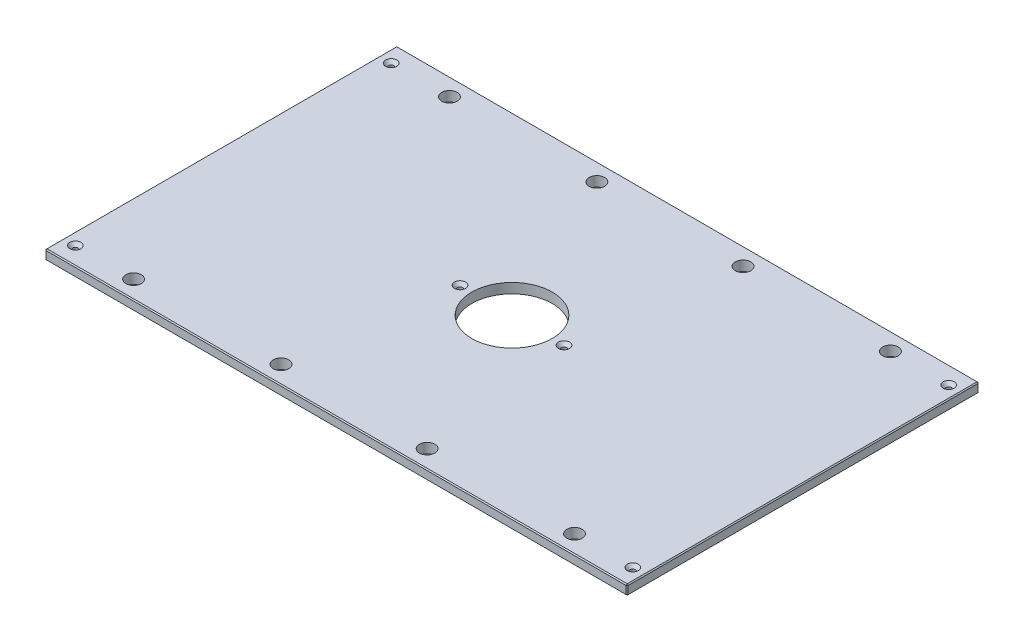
ISO-10303-21;
HEADER;
FILE_DESCRIPTION(('STEP AP214'),'2;1');
FILE_NAME('part.step','',(''),(''),'','','');
FILE_SCHEMA(('AUTOMOTIVE_DESIGN { 1 0 10303 214 1 1 1 1 }'));
ENDSEC;
DATA;
#1=APPLICATION_CONTEXT('core data for automotive mechanical design processes');
#2=APPLICATION_PROTOCOL_DEFINITION('international standard','automotive_design',2000,#1);
#3=PRODUCT_CONTEXT('',#1,'mechanical');
#4=PRODUCT('Part','Part','',(#3));
#5=PRODUCT_RELATED_PRODUCT_CATEGORY('part','',(#4));
#6=PRODUCT_DEFINITION_FORMATION('','',#4);
#7=PRODUCT_DEFINITION_CONTEXT('part definition',#1,'design');
#8=PRODUCT_DEFINITION('design','',#6,#7);
#9=PRODUCT_DEFINITION_SHAPE('','',#8);
#10=(LENGTH_UNIT() NAMED_UNIT(*) SI_UNIT(.MILLI.,.METRE.));
#11=(NAMED_UNIT(*) PLANE_ANGLE_UNIT() SI_UNIT($,.RADIAN.));
#12=(NAMED_UNIT(*) SI_UNIT($,.STERADIAN.) SOLID_ANGLE_UNIT());
#13=UNCERTAINTY_MEASURE_WITH_UNIT(LENGTH_MEASURE(1.E-05),#10,'distance_accuracy_value','');
#14=(GEOMETRIC_REPRESENTATION_CONTEXT(3) GLOBAL_UNCERTAINTY_ASSIGNED_CONTEXT((#13)) GLOBAL_UNIT_ASSIGNED_CONTEXT((#10,
#11,#12)) REPRESENTATION_CONTEXT('',''));
#15=CARTESIAN_POINT('',(0.,0.,0.));
#16=DIRECTION('',(0.,0.,1.));
#17=DIRECTION('',(1.,0.,0.));
#18=AXIS2_PLACEMENT_3D('',#15,#16,#17);
#19=CARTESIAN_POINT('',(-373.0625,12.7,-225.425));
#20=DIRECTION('',(1.,0.,0.));
#21=DIRECTION('',(0.,0.,-1.));
#22=AXIS2_PLACEMENT_3D('',#19,#20,#21);
#23=PLANE('',#22);
#24=DIRECTION('',(0.,0.,-1.));
#25=VECTOR('',#24,1.);
#26=CARTESIAN_POINT('',(-373.0625,11.4299999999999,-225.425));
#27=LINE('',#26,#25);
#28=CARTESIAN_POINT('',(-373.0625,11.4299999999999,224.155));
#29=VERTEX_POINT('',#28);
#30=CARTESIAN_POINT('',(-373.0625,11.4299999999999,-224.155));
#31=VERTEX_POINT('',#30);
#32=EDGE_CURVE('E135',#29,#31,#27,.T.);
#33=ORIENTED_EDGE('',*,*,#32,.T.);
#34=DIRECTION('',(0.,-1.,0.));
#35=VECTOR('',#34,1.);
#36=CARTESIAN_POINT('',(-373.0625,12.7,-224.155));
#37=LINE('',#36,#35);
#38=CARTESIAN_POINT('',(-373.0625,1.2700000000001,-224.155));
#39=VERTEX_POINT('',#38);
#40=EDGE_CURVE('E131',#31,#39,#37,.T.);
#41=ORIENTED_EDGE('',*,*,#40,.T.);
#42=DIRECTION('',(0.,0.,1.));
#43=VECTOR('',#42,1.);
#44=CARTESIAN_POINT('',(-373.0625,1.2700000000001,-225.425));
#45=LINE('',#44,#43);
#46=CARTESIAN_POINT('',(-373.0625,1.2700000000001,224.155));
#47=VERTEX_POINT('',#46);
#48=EDGE_CURVE('E126',#39,#47,#45,.T.);
#49=ORIENTED_EDGE('',*,*,#48,.T.);
#50=DIRECTION('',(0.,1.,0.));
#51=VECTOR('',#50,1.);
#52=CARTESIAN_POINT('',(-373.0625,12.7,224.155));
#53=LINE('',#52,#51);
#54=EDGE_CURVE('E128',#47,#29,#53,.T.);
#55=ORIENTED_EDGE('',*,*,#54,.T.);
#56=EDGE_LOOP('',(#33,#41,#49,#55));
#57=FACE_BOUND('',#56,.T.);
#58=ADVANCED_FACE('F35',(#57),#23,.F.);
#59=CARTESIAN_POINT('',(-373.0625,12.7,225.425));
#60=DIRECTION('',(0.,0.,-1.));
#61=DIRECTION('',(-1.,0.,0.));
#62=AXIS2_PLACEMENT_3D('',#59,#60,#61);
#63=PLANE('',#62);
#64=DIRECTION('',(1.,0.,0.));
#65=VECTOR('',#64,1.);
#66=CARTESIAN_POINT('',(-373.0625,1.2700000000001,225.425));
#67=LINE('',#66,#65);
#68=CARTESIAN_POINT('',(-371.7925,1.2700000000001,225.425));
#69=VERTEX_POINT('',#68);
#70=CARTESIAN_POINT('',(371.7925,1.2700000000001,225.425));
#71=VERTEX_POINT('',#70);
#72=EDGE_CURVE('E58',#69,#71,#67,.T.);
#73=ORIENTED_EDGE('',*,*,#72,.T.);
#74=DIRECTION('',(0.,1.,0.));
#75=VECTOR('',#74,1.);
#76=CARTESIAN_POINT('',(371.7925,12.7,225.425));
#77=LINE('',#76,#75);
#78=CARTESIAN_POINT('',(371.7925,11.4299999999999,225.425));
#79=VERTEX_POINT('',#78);
#80=EDGE_CURVE('E11',#71,#79,#77,.T.);
#81=ORIENTED_EDGE('',*,*,#80,.T.);
#82=DIRECTION('',(-1.,0.,0.));
#83=VECTOR('',#82,1.);
#84=CARTESIAN_POINT('',(-373.0625,11.4299999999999,225.425));
#85=LINE('',#84,#83);
#86=CARTESIAN_POINT('',(-371.7925,11.4299999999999,225.425));
#87=VERTEX_POINT('',#86);
#88=EDGE_CURVE('E44',#79,#87,#85,.T.);
#89=ORIENTED_EDGE('',*,*,#88,.T.);
#90=DIRECTION('',(0.,-1.,0.));
#91=VECTOR('',#90,1.);
#92=CARTESIAN_POINT('',(-371.7925,12.7,225.425));
#93=LINE('',#92,#91);
#94=EDGE_CURVE('E303',#87,#69,#93,.T.);
#95=ORIENTED_EDGE('',*,*,#94,.T.);
#96=EDGE_LOOP('',(#73,#81,#89,#95));
#97=FACE_BOUND('',#96,.T.);
#98=ADVANCED_FACE('F372',(#97),#63,.F.);
#99=CARTESIAN_POINT('',(373.0625,12.7,-225.425));
#100=DIRECTION('',(-1.,0.,0.));
#101=DIRECTION('',(0.,0.,1.));
#102=AXIS2_PLACEMENT_3D('',#99,#100,#101);
#103=PLANE('',#102);
#104=DIRECTION('',(0.,0.,-1.));
#105=VECTOR('',#104,1.);
#106=CARTESIAN_POINT('',(373.0625,1.2700000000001,-225.425));
#107=LINE('',#106,#105);
#108=CARTESIAN_POINT('',(373.0625,1.2700000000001,224.155));
#109=VERTEX_POINT('',#108);
#110=CARTESIAN_POINT('',(373.0625,1.2700000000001,-224.155));
#111=VERTEX_POINT('',#110);
#112=EDGE_CURVE('E298',#109,#111,#107,.T.);
#113=ORIENTED_EDGE('',*,*,#112,.T.);
#114=DIRECTION('',(0.,1.,0.));
#115=VECTOR('',#114,1.);
#116=CARTESIAN_POINT('',(373.0625,12.7,-224.155));
#117=LINE('',#116,#115);
#118=CARTESIAN_POINT('',(373.0625,11.4299999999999,-224.155));
#119=VERTEX_POINT('',#118);
#120=EDGE_CURVE('E300',#111,#119,#117,.T.);
#121=ORIENTED_EDGE('',*,*,#120,.T.);
#122=DIRECTION('',(0.,0.,1.));
#123=VECTOR('',#122,1.);
#124=CARTESIAN_POINT('',(373.0625,11.4299999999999,225.425));
#125=LINE('',#124,#123);
#126=CARTESIAN_POINT('',(373.0625,11.4299999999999,224.155));
#127=VERTEX_POINT('',#126);
#128=EDGE_CURVE('E296',#119,#127,#125,.T.);
#129=ORIENTED_EDGE('',*,*,#128,.T.);
#130=DIRECTION('',(0.,-1.,0.));
#131=VECTOR('',#130,1.);
#132=CARTESIAN_POINT('',(373.0625,12.7,224.155));
#133=LINE('',#132,#131);
#134=EDGE_CURVE('E294',#127,#109,#133,.T.);
#135=ORIENTED_EDGE('',*,*,#134,.T.);
#136=EDGE_LOOP('',(#113,#121,#129,#135));
#137=FACE_BOUND('',#136,.T.);
#138=ADVANCED_FACE('F359',(#137),#103,.F.);
#139=CARTESIAN_POINT('',(-373.0625,12.7,-225.425));
#140=DIRECTION('',(0.,0.,1.));
#141=DIRECTION('',(1.,0.,0.));
#142=AXIS2_PLACEMENT_3D('',#139,#140,#141);
#143=PLANE('',#142);
#144=DIRECTION('',(-1.,0.,0.));
#145=VECTOR('',#144,1.);
#146=CARTESIAN_POINT('',(-373.0625,1.2700000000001,-225.425));
#147=LINE('',#146,#145);
#148=CARTESIAN_POINT('',(371.7925,1.2700000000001,-225.425));
#149=VERTEX_POINT('',#148);
#150=CARTESIAN_POINT('',(-371.7925,1.2700000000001,-225.425));
#151=VERTEX_POINT('',#150);
#152=EDGE_CURVE('E270',#149,#151,#147,.T.);
#153=ORIENTED_EDGE('',*,*,#152,.T.);
#154=DIRECTION('',(0.,1.,0.));
#155=VECTOR('',#154,1.);
#156=CARTESIAN_POINT('',(-371.7925,12.7,-225.425));
#157=LINE('',#156,#155);
#158=CARTESIAN_POINT('',(-371.7925,11.4299999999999,-225.425));
#159=VERTEX_POINT('',#158);
#160=EDGE_CURVE('E274',#151,#159,#157,.T.);
#161=ORIENTED_EDGE('',*,*,#160,.T.);
#162=DIRECTION('',(1.,0.,0.));
#163=VECTOR('',#162,1.);
#164=CARTESIAN_POINT('',(373.0625,11.4299999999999,-225.425));
#165=LINE('',#164,#163);
#166=CARTESIAN_POINT('',(371.7925,11.4299999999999,-225.425));
#167=VERTEX_POINT('',#166);
#168=EDGE_CURVE('E272',#159,#167,#165,.T.);
#169=ORIENTED_EDGE('',*,*,#168,.T.);
#170=DIRECTION('',(0.,-1.,0.));
#171=VECTOR('',#170,1.);
#172=CARTESIAN_POINT('',(371.7925,12.7,-225.425));
#173=LINE('',#172,#171);
#174=EDGE_CURVE('E268',#167,#149,#173,.T.);
#175=ORIENTED_EDGE('',*,*,#174,.T.);
#176=EDGE_LOOP('',(#153,#161,#169,#175));
#177=FACE_BOUND('',#176,.T.);
#178=ADVANCED_FACE('F333',(#177),#143,.F.);
#179=CARTESIAN_POINT('',(0.,12.7,0.));
#180=DIRECTION('',(0.,1.,0.));
#181=DIRECTION('',(0.,0.,1.));
#182=AXIS2_PLACEMENT_3D('',#179,#180,#181);
#183=PLANE('',#182);
#184=CARTESIAN_POINT('',(357.1875,12.7,-202.40498));
#185=DIRECTION('',(0.,1.,0.));
#186=DIRECTION('',(0.,0.,1.));
#187=AXIS2_PLACEMENT_3D('',#184,#185,#186);
#188=CIRCLE('',#187,7.13740000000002);
#189=CARTESIAN_POINT('',(357.1875,12.7,-195.26758));
#190=VERTEX_POINT('',#189);
#191=EDGE_CURVE('E816',#190,#190,#188,.T.);
#192=ORIENTED_EDGE('',*,*,#191,.F.);
#193=EDGE_LOOP('',(#192));
#194=FACE_BOUND('',#193,.T.);
#195=CARTESIAN_POINT('',(357.1875,12.7,202.40498));
#196=DIRECTION('',(0.,1.,0.));
#197=DIRECTION('',(0.,0.,1.));
#198=AXIS2_PLACEMENT_3D('',#195,#196,#197);
#199=CIRCLE('',#198,7.13740000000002);
#200=CARTESIAN_POINT('',(357.1875,12.7,209.54238));
#201=VERTEX_POINT('',#200);
#202=EDGE_CURVE('E820',#201,#201,#199,.T.);
#203=ORIENTED_EDGE('',*,*,#202,.F.);
#204=EDGE_LOOP('',(#203));
#205=FACE_BOUND('',#204,.T.);
#206=CARTESIAN_POINT('',(-357.1875,12.7,202.40498));
#207=DIRECTION('',(0.,1.,0.));
#208=DIRECTION('',(0.,0.,1.));
#209=AXIS2_PLACEMENT_3D('',#206,#207,#208);
#210=CIRCLE('',#209,7.13740000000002);
#211=CARTESIAN_POINT('',(-357.1875,12.7,209.54238));
#212=VERTEX_POINT('',#211);
#213=EDGE_CURVE('E824',#212,#212,#210,.T.);
#214=ORIENTED_EDGE('',*,*,#213,.F.);
#215=EDGE_LOOP('',(#214));
#216=FACE_BOUND('',#215,.T.);
#217=CARTESIAN_POINT('',(-66.675,12.7,0.));
#218=DIRECTION('',(0.,1.,0.));
#219=DIRECTION('',(0.,0.,1.));
#220=AXIS2_PLACEMENT_3D('',#217,#218,#219);
#221=CIRCLE('',#220,7.1374);
#222=CARTESIAN_POINT('',(-66.675,12.7,7.1374));
#223=VERTEX_POINT('',#222);
#224=EDGE_CURVE('E828',#223,#223,#221,.T.);
#225=ORIENTED_EDGE('',*,*,#224,.F.);
#226=EDGE_LOOP('',(#225));
#227=FACE_BOUND('',#226,.T.);
#228=CARTESIAN_POINT('',(66.675,12.7,0.));
#229=DIRECTION('',(0.,1.,0.));
#230=DIRECTION('',(0.,0.,1.));
#231=AXIS2_PLACEMENT_3D('',#228,#229,#230);
#232=CIRCLE('',#231,7.1374);
#233=CARTESIAN_POINT('',(66.675,12.7,7.1374));
#234=VERTEX_POINT('',#233);
#235=EDGE_CURVE('E832',#234,#234,#232,.T.);
#236=ORIENTED_EDGE('',*,*,#235,.F.);
#237=EDGE_LOOP('',(#236));
#238=FACE_BOUND('',#237,.T.);
#239=CARTESIAN_POINT('',(-357.1875,12.7,-202.40498));
#240=DIRECTION('',(0.,1.,0.));
#241=DIRECTION('',(0.,0.,1.));
#242=AXIS2_PLACEMENT_3D('',#239,#240,#241);
#243=CIRCLE('',#242,7.13740000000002);
#244=CARTESIAN_POINT('',(-357.1875,12.7,-195.26758));
#245=VERTEX_POINT('',#244);
#246=EDGE_CURVE('E835',#245,#245,#243,.T.);
#247=ORIENTED_EDGE('',*,*,#246,.F.);
#248=EDGE_LOOP('',(#247));
#249=FACE_BOUND('',#248,.T.);
#250=DIRECTION('',(0.,0.,-1.));
#251=VECTOR('',#250,1.);
#252=CARTESIAN_POINT('',(371.7925,12.7,-225.425));
#253=LINE('',#252,#251);
#254=CARTESIAN_POINT('',(371.7925,12.7,224.155));
#255=VERTEX_POINT('',#254);
#256=CARTESIAN_POINT('',(371.7925,12.7,-224.155));
#257=VERTEX_POINT('',#256);
#258=EDGE_CURVE('E281',#255,#257,#253,.T.);
#259=ORIENTED_EDGE('',*,*,#258,.T.);
#260=DIRECTION('',(-1.,0.,0.));
#261=VECTOR('',#260,1.);
#262=CARTESIAN_POINT('',(-373.0625,12.7,-224.155));
#263=LINE('',#262,#261);
#264=CARTESIAN_POINT('',(-371.7925,12.7,-224.155));
#265=VERTEX_POINT('',#264);
#266=EDGE_CURVE('E283',#257,#265,#263,.T.);
#267=ORIENTED_EDGE('',*,*,#266,.T.);
#268=DIRECTION('',(0.,0.,1.));
#269=VECTOR('',#268,1.);
#270=CARTESIAN_POINT('',(-371.7925,12.7,225.425));
#271=LINE('',#270,#269);
#272=CARTESIAN_POINT('',(-371.7925,12.7,224.155));
#273=VERTEX_POINT('',#272);
#274=EDGE_CURVE('E279',#265,#273,#271,.T.);
#275=ORIENTED_EDGE('',*,*,#274,.T.);
#276=DIRECTION('',(1.,0.,0.));
#277=VECTOR('',#276,1.);
#278=CARTESIAN_POINT('',(373.0625,12.7,224.155));
#279=LINE('',#278,#277);
#280=EDGE_CURVE('E277',#273,#255,#279,.T.);
#281=ORIENTED_EDGE('',*,*,#280,.T.);
#282=EDGE_LOOP('',(#259,#267,#275,#281));
#283=FACE_BOUND('',#282,.T.);
#284=CARTESIAN_POINT('',(282.575,12.7,-202.40498));
#285=DIRECTION('',(0.,1.,0.));
#286=DIRECTION('',(0.,0.,1.));
#287=AXIS2_PLACEMENT_3D('',#284,#285,#286);
#288=CIRCLE('',#287,9.92187500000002);
#289=CARTESIAN_POINT('',(282.575,12.7,-192.483105));
#290=VERTEX_POINT('',#289);
#291=EDGE_CURVE('E204',#290,#290,#288,.T.);
#292=ORIENTED_EDGE('',*,*,#291,.F.);
#293=EDGE_LOOP('',(#292));
#294=FACE_BOUND('',#293,.T.);
#295=CARTESIAN_POINT('',(-282.575,12.7,-202.40498));
#296=DIRECTION('',(0.,1.,0.));
#297=DIRECTION('',(0.,0.,1.));
#298=AXIS2_PLACEMENT_3D('',#295,#296,#297);
#299=CIRCLE('',#298,9.92187500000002);
#300=CARTESIAN_POINT('',(-282.575,12.7,-192.483105));
#301=VERTEX_POINT('',#300);
#302=EDGE_CURVE('E214',#301,#301,#299,.T.);
#303=ORIENTED_EDGE('',*,*,#302,.F.);
#304=EDGE_LOOP('',(#303));
#305=FACE_BOUND('',#304,.T.);
#306=CARTESIAN_POINT('',(282.575,12.7,202.40498));
#307=DIRECTION('',(0.,1.,0.));
#308=DIRECTION('',(0.,0.,1.));
#309=AXIS2_PLACEMENT_3D('',#306,#307,#308);
#310=CIRCLE('',#309,9.92187500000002);
#311=CARTESIAN_POINT('',(282.575,12.7,212.326855));
#312=VERTEX_POINT('',#311);
#313=EDGE_CURVE('E225',#312,#312,#310,.T.);
#314=ORIENTED_EDGE('',*,*,#313,.F.);
#315=EDGE_LOOP('',(#314));
#316=FACE_BOUND('',#315,.T.);
#317=CARTESIAN_POINT('',(-282.575,12.7,202.40498));
#318=DIRECTION('',(0.,1.,0.));
#319=DIRECTION('',(0.,0.,1.));
#320=AXIS2_PLACEMENT_3D('',#317,#318,#319);
#321=CIRCLE('',#320,9.92187500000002);
#322=CARTESIAN_POINT('',(-282.575,12.7,212.326855));
#323=VERTEX_POINT('',#322);
#324=EDGE_CURVE('E231',#323,#323,#321,.T.);
#325=ORIENTED_EDGE('',*,*,#324,.F.);
#326=EDGE_LOOP('',(#325));
#327=FACE_BOUND('',#326,.T.);
#328=CARTESIAN_POINT('',(-93.6625,12.7,-202.40498));
#329=DIRECTION('',(0.,1.,0.));
#330=DIRECTION('',(0.,0.,1.));
#331=AXIS2_PLACEMENT_3D('',#328,#329,#330);
#332=CIRCLE('',#331,9.921875);
#333=CARTESIAN_POINT('',(-93.6625,12.7,-192.483105));
#334=VERTEX_POINT('',#333);
#335=EDGE_CURVE('E237',#334,#334,#332,.T.);
#336=ORIENTED_EDGE('',*,*,#335,.F.);
#337=EDGE_LOOP('',(#336));
#338=FACE_BOUND('',#337,.T.);
#339=CARTESIAN_POINT('',(93.6625,12.7,-202.40498));
#340=DIRECTION('',(0.,1.,0.));
#341=DIRECTION('',(0.,0.,1.));
#342=AXIS2_PLACEMENT_3D('',#339,#340,#341);
#343=CIRCLE('',#342,9.921875);
#344=CARTESIAN_POINT('',(93.6625,12.7,-192.483105));
#345=VERTEX_POINT('',#344);
#346=EDGE_CURVE('E243',#345,#345,#343,.T.);
#347=ORIENTED_EDGE('',*,*,#346,.F.);
#348=EDGE_LOOP('',(#347));
#349=FACE_BOUND('',#348,.T.);
#350=CARTESIAN_POINT('',(93.6625,12.7,202.40498));
#351=DIRECTION('',(0.,1.,0.));
#352=DIRECTION('',(0.,0.,1.));
#353=AXIS2_PLACEMENT_3D('',#350,#351,#352);
#354=CIRCLE('',#353,9.921875);
#355=CARTESIAN_POINT('',(93.6625,12.7,212.326855));
#356=VERTEX_POINT('',#355);
#357=EDGE_CURVE('E249',#356,#356,#354,.T.);
#358=ORIENTED_EDGE('',*,*,#357,.F.);
#359=EDGE_LOOP('',(#358));
#360=FACE_BOUND('',#359,.T.);
#361=CARTESIAN_POINT('',(-93.6625,12.7,202.40498));
#362=DIRECTION('',(0.,1.,0.));
#363=DIRECTION('',(0.,0.,1.));
#364=AXIS2_PLACEMENT_3D('',#361,#362,#363);
#365=CIRCLE('',#364,9.921875);
#366=CARTESIAN_POINT('',(-93.6625,12.7,212.326855));
#367=VERTEX_POINT('',#366);
#368=EDGE_CURVE('E255',#367,#367,#365,.T.);
#369=ORIENTED_EDGE('',*,*,#368,.F.);
#370=EDGE_LOOP('',(#369));
#371=FACE_BOUND('',#370,.T.);
#372=CARTESIAN_POINT('',(0.,12.7,0.));
#373=DIRECTION('',(0.,1.,0.));
#374=DIRECTION('',(0.,0.,1.));
#375=AXIS2_PLACEMENT_3D('',#372,#373,#374);
#376=CIRCLE('',#375,51.562);
#377=CARTESIAN_POINT('',(0.,12.7,51.562));
#378=VERTEX_POINT('',#377);
#379=EDGE_CURVE('E261',#378,#378,#376,.T.);
#380=ORIENTED_EDGE('',*,*,#379,.F.);
#381=EDGE_LOOP('',(#380));
#382=FACE_BOUND('',#381,.T.);
#383=ADVANCED_FACE('F381',(#194,#205,#216,#227,#238,#249,#283,#294,#305,#316,#327,#338,#349,
#360,#371,#382),#183,.T.);
#384=CARTESIAN_POINT('',(0.,0.,0.));
#385=DIRECTION('',(0.,1.,0.));
#386=DIRECTION('',(0.,0.,1.));
#387=AXIS2_PLACEMENT_3D('',#384,#385,#386);
#388=PLANE('',#387);
#389=CARTESIAN_POINT('',(357.1875,0.,-202.40498));
#390=DIRECTION('',(0.,1.,0.));
#391=DIRECTION('',(0.,0.,1.));
#392=AXIS2_PLACEMENT_3D('',#389,#390,#391);
#393=CIRCLE('',#392,3.3782);
#394=CARTESIAN_POINT('',(357.1875,0.,-199.02678));
#395=VERTEX_POINT('',#394);
#396=EDGE_CURVE('E869',#395,#395,#393,.T.);
#397=ORIENTED_EDGE('',*,*,#396,.T.);
#398=EDGE_LOOP('',(#397));
#399=FACE_BOUND('',#398,.T.);
#400=CARTESIAN_POINT('',(357.1875,0.,202.40498));
#401=DIRECTION('',(0.,1.,0.));
#402=DIRECTION('',(0.,0.,1.));
#403=AXIS2_PLACEMENT_3D('',#400,#401,#402);
#404=CIRCLE('',#403,3.3782);
#405=CARTESIAN_POINT('',(357.1875,0.,205.78318));
#406=VERTEX_POINT('',#405);
#407=EDGE_CURVE('E862',#406,#406,#404,.T.);
#408=ORIENTED_EDGE('',*,*,#407,.T.);
#409=EDGE_LOOP('',(#408));
#410=FACE_BOUND('',#409,.T.);
#411=CARTESIAN_POINT('',(-357.1875,0.,202.40498));
#412=DIRECTION('',(0.,1.,0.));
#413=DIRECTION('',(0.,0.,1.));
#414=AXIS2_PLACEMENT_3D('',#411,#412,#413);
#415=CIRCLE('',#414,3.3782);
#416=CARTESIAN_POINT('',(-357.1875,0.,205.78318));
#417=VERTEX_POINT('',#416);
#418=EDGE_CURVE('E855',#417,#417,#415,.T.);
#419=ORIENTED_EDGE('',*,*,#418,.T.);
#420=EDGE_LOOP('',(#419));
#421=FACE_BOUND('',#420,.T.);
#422=CARTESIAN_POINT('',(-66.675,0.,0.));
#423=DIRECTION('',(0.,1.,0.));
#424=DIRECTION('',(0.,0.,1.));
#425=AXIS2_PLACEMENT_3D('',#422,#423,#424);
#426=CIRCLE('',#425,3.3782);
#427=CARTESIAN_POINT('',(-66.675,0.,3.3782));
#428=VERTEX_POINT('',#427);
#429=EDGE_CURVE('E848',#428,#428,#426,.T.);
#430=ORIENTED_EDGE('',*,*,#429,.T.);
#431=EDGE_LOOP('',(#430));
#432=FACE_BOUND('',#431,.T.);
#433=CARTESIAN_POINT('',(66.675,0.,0.));
#434=DIRECTION('',(0.,1.,0.));
#435=DIRECTION('',(0.,0.,1.));
#436=AXIS2_PLACEMENT_3D('',#433,#434,#435);
#437=CIRCLE('',#436,3.3782);
#438=CARTESIAN_POINT('',(66.675,0.,3.3782));
#439=VERTEX_POINT('',#438);
#440=EDGE_CURVE('E838',#439,#439,#437,.T.);
#441=ORIENTED_EDGE('',*,*,#440,.T.);
#442=EDGE_LOOP('',(#441));
#443=FACE_BOUND('',#442,.T.);
#444=CARTESIAN_POINT('',(-357.1875,0.,-202.40498));
#445=DIRECTION('',(0.,1.,0.));
#446=DIRECTION('',(0.,0.,1.));
#447=AXIS2_PLACEMENT_3D('',#444,#445,#446);
#448=CIRCLE('',#447,3.3782);
#449=CARTESIAN_POINT('',(-357.1875,0.,-199.02678));
#450=VERTEX_POINT('',#449);
#451=EDGE_CURVE('E217',#450,#450,#448,.T.);
#452=ORIENTED_EDGE('',*,*,#451,.T.);
#453=EDGE_LOOP('',(#452));
#454=FACE_BOUND('',#453,.T.);
#455=DIRECTION('',(0.,0.,-1.));
#456=VECTOR('',#455,1.);
#457=CARTESIAN_POINT('',(-371.7925,0.,0.));
#458=LINE('',#457,#456);
#459=CARTESIAN_POINT('',(-371.7925,0.,224.155));
#460=VERTEX_POINT('',#459);
#461=CARTESIAN_POINT('',(-371.7925,0.,-224.155));
#462=VERTEX_POINT('',#461);
#463=EDGE_CURVE('E158',#460,#462,#458,.T.);
#464=ORIENTED_EDGE('',*,*,#463,.T.);
#465=DIRECTION('',(1.,0.,0.));
#466=VECTOR('',#465,1.);
#467=CARTESIAN_POINT('',(0.,0.,-224.155));
#468=LINE('',#467,#466);
#469=CARTESIAN_POINT('',(371.7925,0.,-224.155));
#470=VERTEX_POINT('',#469);
#471=EDGE_CURVE('E291',#462,#470,#468,.T.);
#472=ORIENTED_EDGE('',*,*,#471,.T.);
#473=DIRECTION('',(0.,0.,1.));
#474=VECTOR('',#473,1.);
#475=CARTESIAN_POINT('',(371.7925,0.,0.));
#476=LINE('',#475,#474);
#477=CARTESIAN_POINT('',(371.7925,0.,224.155));
#478=VERTEX_POINT('',#477);
#479=EDGE_CURVE('E289',#470,#478,#476,.T.);
#480=ORIENTED_EDGE('',*,*,#479,.T.);
#481=DIRECTION('',(-1.,0.,0.));
#482=VECTOR('',#481,1.);
#483=CARTESIAN_POINT('',(0.,0.,224.155));
#484=LINE('',#483,#482);
#485=EDGE_CURVE('E286',#478,#460,#484,.T.);
#486=ORIENTED_EDGE('',*,*,#485,.T.);
#487=EDGE_LOOP('',(#464,#472,#480,#486));
#488=FACE_BOUND('',#487,.T.);
#489=CARTESIAN_POINT('',(282.575,0.,-202.40498));
#490=DIRECTION('',(0.,1.,0.));
#491=DIRECTION('',(0.,0.,1.));
#492=AXIS2_PLACEMENT_3D('',#489,#490,#491);
#493=CIRCLE('',#492,9.92187500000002);
#494=CARTESIAN_POINT('',(282.575,0.,-192.483105));
#495=VERTEX_POINT('',#494);
#496=EDGE_CURVE('E209',#495,#495,#493,.T.);
#497=ORIENTED_EDGE('',*,*,#496,.T.);
#498=EDGE_LOOP('',(#497));
#499=FACE_BOUND('',#498,.T.);
#500=CARTESIAN_POINT('',(-282.575,0.,-202.40498));
#501=DIRECTION('',(0.,1.,0.));
#502=DIRECTION('',(0.,0.,1.));
#503=AXIS2_PLACEMENT_3D('',#500,#501,#502);
#504=CIRCLE('',#503,9.92187500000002);
#505=CARTESIAN_POINT('',(-282.575,0.,-192.483105));
#506=VERTEX_POINT('',#505);
#507=EDGE_CURVE('E222',#506,#506,#504,.T.);
#508=ORIENTED_EDGE('',*,*,#507,.T.);
#509=EDGE_LOOP('',(#508));
#510=FACE_BOUND('',#509,.T.);
#511=CARTESIAN_POINT('',(282.575,0.,202.40498));
#512=DIRECTION('',(0.,1.,0.));
#513=DIRECTION('',(0.,0.,1.));
#514=AXIS2_PLACEMENT_3D('',#511,#512,#513);
#515=CIRCLE('',#514,9.92187500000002);
#516=CARTESIAN_POINT('',(282.575,0.,212.326855));
#517=VERTEX_POINT('',#516);
#518=EDGE_CURVE('E228',#517,#517,#515,.T.);
#519=ORIENTED_EDGE('',*,*,#518,.T.);
#520=EDGE_LOOP('',(#519));
#521=FACE_BOUND('',#520,.T.);
#522=CARTESIAN_POINT('',(-282.575,0.,202.40498));
#523=DIRECTION('',(0.,1.,0.));
#524=DIRECTION('',(0.,0.,1.));
#525=AXIS2_PLACEMENT_3D('',#522,#523,#524);
#526=CIRCLE('',#525,9.92187500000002);
#527=CARTESIAN_POINT('',(-282.575,0.,212.326855));
#528=VERTEX_POINT('',#527);
#529=EDGE_CURVE('E234',#528,#528,#526,.T.);
#530=ORIENTED_EDGE('',*,*,#529,.T.);
#531=EDGE_LOOP('',(#530));
#532=FACE_BOUND('',#531,.T.);
#533=CARTESIAN_POINT('',(-93.6625,0.,-202.40498));
#534=DIRECTION('',(0.,1.,0.));
#535=DIRECTION('',(0.,0.,1.));
#536=AXIS2_PLACEMENT_3D('',#533,#534,#535);
#537=CIRCLE('',#536,9.921875);
#538=CARTESIAN_POINT('',(-93.6625,0.,-192.483105));
#539=VERTEX_POINT('',#538);
#540=EDGE_CURVE('E240',#539,#539,#537,.T.);
#541=ORIENTED_EDGE('',*,*,#540,.T.);
#542=EDGE_LOOP('',(#541));
#543=FACE_BOUND('',#542,.T.);
#544=CARTESIAN_POINT('',(93.6625,0.,-202.40498));
#545=DIRECTION('',(0.,1.,0.));
#546=DIRECTION('',(0.,0.,1.));
#547=AXIS2_PLACEMENT_3D('',#544,#545,#546);
#548=CIRCLE('',#547,9.921875);
#549=CARTESIAN_POINT('',(93.6625,0.,-192.483105));
#550=VERTEX_POINT('',#549);
#551=EDGE_CURVE('E246',#550,#550,#548,.T.);
#552=ORIENTED_EDGE('',*,*,#551,.T.);
#553=EDGE_LOOP('',(#552));
#554=FACE_BOUND('',#553,.T.);
#555=CARTESIAN_POINT('',(93.6625,0.,202.40498));
#556=DIRECTION('',(0.,1.,0.));
#557=DIRECTION('',(0.,0.,1.));
#558=AXIS2_PLACEMENT_3D('',#555,#556,#557);
#559=CIRCLE('',#558,9.921875);
#560=CARTESIAN_POINT('',(93.6625,0.,212.326855));
#561=VERTEX_POINT('',#560);
#562=EDGE_CURVE('E252',#561,#561,#559,.T.);
#563=ORIENTED_EDGE('',*,*,#562,.T.);
#564=EDGE_LOOP('',(#563));
#565=FACE_BOUND('',#564,.T.);
#566=CARTESIAN_POINT('',(-93.6625,0.,202.40498));
#567=DIRECTION('',(0.,1.,0.));
#568=DIRECTION('',(0.,0.,1.));
#569=AXIS2_PLACEMENT_3D('',#566,#567,#568);
#570=CIRCLE('',#569,9.921875);
#571=CARTESIAN_POINT('',(-93.6625,0.,212.326855));
#572=VERTEX_POINT('',#571);
#573=EDGE_CURVE('E258',#572,#572,#570,.T.);
#574=ORIENTED_EDGE('',*,*,#573,.T.);
#575=EDGE_LOOP('',(#574));
#576=FACE_BOUND('',#575,.T.);
#577=CARTESIAN_POINT('',(0.,0.,0.));
#578=DIRECTION('',(0.,1.,0.));
#579=DIRECTION('',(0.,0.,1.));
#580=AXIS2_PLACEMENT_3D('',#577,#578,#579);
#581=CIRCLE('',#580,51.562);
#582=CARTESIAN_POINT('',(0.,0.,51.562));
#583=VERTEX_POINT('',#582);
#584=EDGE_CURVE('E147',#583,#583,#581,.T.);
#585=ORIENTED_EDGE('',*,*,#584,.T.);
#586=EDGE_LOOP('',(#585));
#587=FACE_BOUND('',#586,.T.);
#588=ADVANCED_FACE('F346',(#399,#410,#421,#432,#443,#454,#488,#499,#510,#521,#532,#543,#554,
#565,#576,#587),#388,.F.);
#589=CARTESIAN_POINT('',(0.,0.,0.));
#590=DIRECTION('',(0.,1.,0.));
#591=DIRECTION('',(0.,0.,1.));
#592=AXIS2_PLACEMENT_3D('',#589,#590,#591);
#593=CYLINDRICAL_SURFACE('',#592,51.562);
#594=ORIENTED_EDGE('',*,*,#584,.F.);
#595=EDGE_LOOP('',(#594));
#596=FACE_BOUND('',#595,.T.);
#597=ORIENTED_EDGE('',*,*,#379,.T.);
#598=EDGE_LOOP('',(#597));
#599=FACE_BOUND('',#598,.T.);
#600=ADVANCED_FACE('F751',(#596,#599),#593,.F.);
#601=CARTESIAN_POINT('',(-93.6625,12.7,202.40498));
#602=DIRECTION('',(0.,1.,0.));
#603=DIRECTION('',(0.,0.,1.));
#604=AXIS2_PLACEMENT_3D('',#601,#602,#603);
#605=CYLINDRICAL_SURFACE('',#604,9.921875);
#606=ORIENTED_EDGE('',*,*,#573,.F.);
#607=EDGE_LOOP('',(#606));
#608=FACE_BOUND('',#607,.T.);
#609=ORIENTED_EDGE('',*,*,#368,.T.);
#610=EDGE_LOOP('',(#609));
#611=FACE_BOUND('',#610,.T.);
#612=ADVANCED_FACE('F742',(#608,#611),#605,.F.);
#613=CARTESIAN_POINT('',(93.6625,12.7,202.40498));
#614=DIRECTION('',(0.,1.,0.));
#615=DIRECTION('',(0.,0.,1.));
#616=AXIS2_PLACEMENT_3D('',#613,#614,#615);
#617=CYLINDRICAL_SURFACE('',#616,9.921875);
#618=ORIENTED_EDGE('',*,*,#562,.F.);
#619=EDGE_LOOP('',(#618));
#620=FACE_BOUND('',#619,.T.);
#621=ORIENTED_EDGE('',*,*,#357,.T.);
#622=EDGE_LOOP('',(#621));
#623=FACE_BOUND('',#622,.T.);
#624=ADVANCED_FACE('F733',(#620,#623),#617,.F.);
#625=CARTESIAN_POINT('',(93.6625,12.7,-202.40498));
#626=DIRECTION('',(0.,1.,0.));
#627=DIRECTION('',(0.,0.,1.));
#628=AXIS2_PLACEMENT_3D('',#625,#626,#627);
#629=CYLINDRICAL_SURFACE('',#628,9.921875);
#630=ORIENTED_EDGE('',*,*,#551,.F.);
#631=EDGE_LOOP('',(#630));
#632=FACE_BOUND('',#631,.T.);
#633=ORIENTED_EDGE('',*,*,#346,.T.);
#634=EDGE_LOOP('',(#633));
#635=FACE_BOUND('',#634,.T.);
#636=ADVANCED_FACE('F724',(#632,#635),#629,.F.);
#637=CARTESIAN_POINT('',(-93.6625,12.7,-202.40498));
#638=DIRECTION('',(0.,1.,0.));
#639=DIRECTION('',(0.,0.,1.));
#640=AXIS2_PLACEMENT_3D('',#637,#638,#639);
#641=CYLINDRICAL_SURFACE('',#640,9.921875);
#642=ORIENTED_EDGE('',*,*,#540,.F.);
#643=EDGE_LOOP('',(#642));
#644=FACE_BOUND('',#643,.T.);
#645=ORIENTED_EDGE('',*,*,#335,.T.);
#646=EDGE_LOOP('',(#645));
#647=FACE_BOUND('',#646,.T.);
#648=ADVANCED_FACE('F715',(#644,#647),#641,.F.);
#649=CARTESIAN_POINT('',(-282.575,12.7,202.40498));
#650=DIRECTION('',(0.,1.,0.));
#651=DIRECTION('',(0.,0.,1.));
#652=AXIS2_PLACEMENT_3D('',#649,#650,#651);
#653=CYLINDRICAL_SURFACE('',#652,9.92187500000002);
#654=ORIENTED_EDGE('',*,*,#529,.F.);
#655=EDGE_LOOP('',(#654));
#656=FACE_BOUND('',#655,.T.);
#657=ORIENTED_EDGE('',*,*,#324,.T.);
#658=EDGE_LOOP('',(#657));
#659=FACE_BOUND('',#658,.T.);
#660=ADVANCED_FACE('F706',(#656,#659),#653,.F.);
#661=CARTESIAN_POINT('',(282.575,12.7,202.40498));
#662=DIRECTION('',(0.,1.,0.));
#663=DIRECTION('',(0.,0.,1.));
#664=AXIS2_PLACEMENT_3D('',#661,#662,#663);
#665=CYLINDRICAL_SURFACE('',#664,9.92187500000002);
#666=ORIENTED_EDGE('',*,*,#518,.F.);
#667=EDGE_LOOP('',(#666));
#668=FACE_BOUND('',#667,.T.);
#669=ORIENTED_EDGE('',*,*,#313,.T.);
#670=EDGE_LOOP('',(#669));
#671=FACE_BOUND('',#670,.T.);
#672=ADVANCED_FACE('F697',(#668,#671),#665,.F.);
#673=CARTESIAN_POINT('',(-282.575,12.7,-202.40498));
#674=DIRECTION('',(0.,1.,0.));
#675=DIRECTION('',(0.,0.,1.));
#676=AXIS2_PLACEMENT_3D('',#673,#674,#675);
#677=CYLINDRICAL_SURFACE('',#676,9.92187500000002);
#678=ORIENTED_EDGE('',*,*,#507,.F.);
#679=EDGE_LOOP('',(#678));
#680=FACE_BOUND('',#679,.T.);
#681=ORIENTED_EDGE('',*,*,#302,.T.);
#682=EDGE_LOOP('',(#681));
#683=FACE_BOUND('',#682,.T.);
#684=ADVANCED_FACE('F687',(#680,#683),#677,.F.);
#685=CARTESIAN_POINT('',(282.575,12.7,-202.40498));
#686=DIRECTION('',(0.,1.,0.));
#687=DIRECTION('',(0.,0.,1.));
#688=AXIS2_PLACEMENT_3D('',#685,#686,#687);
#689=CYLINDRICAL_SURFACE('',#688,9.92187500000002);
#690=ORIENTED_EDGE('',*,*,#496,.F.);
#691=EDGE_LOOP('',(#690));
#692=FACE_BOUND('',#691,.T.);
#693=ORIENTED_EDGE('',*,*,#291,.T.);
#694=EDGE_LOOP('',(#693));
#695=FACE_BOUND('',#694,.T.);
#696=ADVANCED_FACE('F390',(#692,#695),#689,.F.);
#697=CARTESIAN_POINT('',(373.0625,12.7,224.155));
#698=DIRECTION('',(-0.707106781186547,0.,-0.707106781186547));
#699=DIRECTION('',(0.,-1.,0.));
#700=AXIS2_PLACEMENT_3D('',#697,#698,#699);
#701=PLANE('',#700);
#702=DIRECTION('',(-0.707106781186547,0.,0.707106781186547));
#703=VECTOR('',#702,1.);
#704=CARTESIAN_POINT('',(373.0625,11.4299999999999,224.155));
#705=LINE('',#704,#703);
#706=EDGE_CURVE('E39',#79,#127,#705,.F.);
#707=ORIENTED_EDGE('',*,*,#706,.F.);
#708=ORIENTED_EDGE('',*,*,#80,.F.);
#709=DIRECTION('',(0.707106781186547,0.,-0.707106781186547));
#710=VECTOR('',#709,1.);
#711=CARTESIAN_POINT('',(372.4275,1.2700000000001,224.79));
#712=LINE('',#711,#710);
#713=EDGE_CURVE('E197',#109,#71,#712,.F.);
#714=ORIENTED_EDGE('',*,*,#713,.F.);
#715=ORIENTED_EDGE('',*,*,#134,.F.);
#716=EDGE_LOOP('',(#707,#708,#714,#715));
#717=FACE_BOUND('',#716,.T.);
#718=ADVANCED_FACE('F37',(#717),#701,.F.);
#719=CARTESIAN_POINT('',(373.0625,11.4299999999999,224.155));
#720=DIRECTION('',(0.577350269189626,0.577350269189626,0.577350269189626));
#721=DIRECTION('',(0.707106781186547,0.,-0.707106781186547));
#722=AXIS2_PLACEMENT_3D('',#719,#720,#721);
#723=PLANE('',#722);
#724=DIRECTION('',(0.,-0.707106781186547,0.707106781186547));
#725=VECTOR('',#724,1.);
#726=CARTESIAN_POINT('',(371.7925,12.0649999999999,224.79));
#727=LINE('',#726,#725);
#728=EDGE_CURVE('E193',#79,#255,#727,.F.);
#729=ORIENTED_EDGE('',*,*,#728,.F.);
#730=ORIENTED_EDGE('',*,*,#706,.T.);
#731=DIRECTION('',(-0.707106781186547,0.707106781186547,0.));
#732=VECTOR('',#731,1.);
#733=CARTESIAN_POINT('',(373.0625,11.4299999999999,224.155));
#734=LINE('',#733,#732);
#735=EDGE_CURVE('E195',#255,#127,#734,.F.);
#736=ORIENTED_EDGE('',*,*,#735,.F.);
#737=EDGE_LOOP('',(#729,#730,#736));
#738=FACE_BOUND('',#737,.T.);
#739=ADVANCED_FACE('F383',(#738),#723,.T.);
#740=CARTESIAN_POINT('',(371.7925,0.,224.155));
#741=DIRECTION('',(0.577350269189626,-0.577350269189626,0.577350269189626));
#742=DIRECTION('',(0.707106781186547,0.,-0.707106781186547));
#743=AXIS2_PLACEMENT_3D('',#740,#741,#742);
#744=PLANE('',#743);
#745=DIRECTION('',(-0.707106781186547,-0.707106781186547,0.));
#746=VECTOR('',#745,1.);
#747=CARTESIAN_POINT('',(371.7925,0.,224.155));
#748=LINE('',#747,#746);
#749=EDGE_CURVE('E187',#109,#478,#748,.T.);
#750=ORIENTED_EDGE('',*,*,#749,.F.);
#751=ORIENTED_EDGE('',*,*,#713,.T.);
#752=DIRECTION('',(0.,0.707106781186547,0.707106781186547));
#753=VECTOR('',#752,1.);
#754=CARTESIAN_POINT('',(371.7925,0.,224.155));
#755=LINE('',#754,#753);
#756=EDGE_CURVE('E190',#478,#71,#755,.T.);
#757=ORIENTED_EDGE('',*,*,#756,.F.);
#758=EDGE_LOOP('',(#750,#751,#757));
#759=FACE_BOUND('',#758,.T.);
#760=ADVANCED_FACE('F352',(#759),#744,.T.);
#761=CARTESIAN_POINT('',(371.7925,12.7,0.));
#762=DIRECTION('',(0.707106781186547,0.707106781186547,0.));
#763=DIRECTION('',(0.,0.,1.));
#764=AXIS2_PLACEMENT_3D('',#761,#762,#763);
#765=PLANE('',#764);
#766=ORIENTED_EDGE('',*,*,#735,.T.);
#767=ORIENTED_EDGE('',*,*,#128,.F.);
#768=DIRECTION('',(0.707106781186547,-0.707106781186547,0.));
#769=VECTOR('',#768,1.);
#770=CARTESIAN_POINT('',(372.4275,12.0649999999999,-224.155));
#771=LINE('',#770,#769);
#772=EDGE_CURVE('E182',#257,#119,#771,.T.);
#773=ORIENTED_EDGE('',*,*,#772,.F.);
#774=ORIENTED_EDGE('',*,*,#258,.F.);
#775=EDGE_LOOP('',(#766,#767,#773,#774));
#776=FACE_BOUND('',#775,.T.);
#777=ADVANCED_FACE('F369',(#776),#765,.T.);
#778=CARTESIAN_POINT('',(0.,12.7,224.155));
#779=DIRECTION('',(0.,0.707106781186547,0.707106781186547));
#780=DIRECTION('',(-1.,0.,0.));
#781=AXIS2_PLACEMENT_3D('',#778,#779,#780);
#782=PLANE('',#781);
#783=ORIENTED_EDGE('',*,*,#728,.T.);
#784=ORIENTED_EDGE('',*,*,#280,.F.);
#785=DIRECTION('',(0.,0.707106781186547,-0.707106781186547));
#786=VECTOR('',#785,1.);
#787=CARTESIAN_POINT('',(-371.7925,12.7,224.155));
#788=LINE('',#787,#786);
#789=EDGE_CURVE('E179',#87,#273,#788,.T.);
#790=ORIENTED_EDGE('',*,*,#789,.F.);
#791=ORIENTED_EDGE('',*,*,#88,.F.);
#792=EDGE_LOOP('',(#783,#784,#790,#791));
#793=FACE_BOUND('',#792,.T.);
#794=ADVANCED_FACE('F374',(#793),#782,.T.);
#795=CARTESIAN_POINT('',(-371.7925,12.7,225.425));
#796=DIRECTION('',(0.707106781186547,0.,-0.707106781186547));
#797=DIRECTION('',(0.,-1.,0.));
#798=AXIS2_PLACEMENT_3D('',#795,#796,#797);
#799=PLANE('',#798);
#800=DIRECTION('',(0.707106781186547,0.,0.707106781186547));
#801=VECTOR('',#800,1.);
#802=CARTESIAN_POINT('',(-373.0625,1.2700000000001,224.155));
#803=LINE('',#802,#801);
#804=EDGE_CURVE('E142',#69,#47,#803,.F.);
#805=ORIENTED_EDGE('',*,*,#804,.F.);
#806=ORIENTED_EDGE('',*,*,#94,.F.);
#807=DIRECTION('',(-0.707106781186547,0.,-0.707106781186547));
#808=VECTOR('',#807,1.);
#809=CARTESIAN_POINT('',(-372.4275,11.4299999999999,224.79));
#810=LINE('',#809,#808);
#811=EDGE_CURVE('E145',#29,#87,#810,.F.);
#812=ORIENTED_EDGE('',*,*,#811,.F.);
#813=ORIENTED_EDGE('',*,*,#54,.F.);
#814=EDGE_LOOP('',(#805,#806,#812,#813));
#815=FACE_BOUND('',#814,.T.);
#816=ADVANCED_FACE('F140',(#815),#799,.F.);
#817=CARTESIAN_POINT('',(-373.0625,1.2700000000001,225.425));
#818=DIRECTION('',(0.,0.707106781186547,-0.707106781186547));
#819=DIRECTION('',(1.,0.,0.));
#820=AXIS2_PLACEMENT_3D('',#817,#818,#819);
#821=PLANE('',#820);
#822=ORIENTED_EDGE('',*,*,#756,.T.);
#823=ORIENTED_EDGE('',*,*,#72,.F.);
#824=DIRECTION('',(0.,-0.707106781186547,-0.707106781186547));
#825=VECTOR('',#824,1.);
#826=CARTESIAN_POINT('',(-371.7925,0.635000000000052,224.79));
#827=LINE('',#826,#825);
#828=EDGE_CURVE('E155',#460,#69,#827,.F.);
#829=ORIENTED_EDGE('',*,*,#828,.F.);
#830=ORIENTED_EDGE('',*,*,#485,.F.);
#831=EDGE_LOOP('',(#822,#823,#829,#830));
#832=FACE_BOUND('',#831,.T.);
#833=ADVANCED_FACE('F351',(#832),#821,.F.);
#834=CARTESIAN_POINT('',(373.0625,1.2700000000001,-225.425));
#835=DIRECTION('',(-0.707106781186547,0.707106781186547,0.));
#836=DIRECTION('',(0.,0.,-1.));
#837=AXIS2_PLACEMENT_3D('',#834,#835,#836);
#838=PLANE('',#837);
#839=ORIENTED_EDGE('',*,*,#749,.T.);
#840=ORIENTED_EDGE('',*,*,#479,.F.);
#841=DIRECTION('',(0.707106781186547,0.707106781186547,0.));
#842=VECTOR('',#841,1.);
#843=CARTESIAN_POINT('',(371.7925,0.,-224.155));
#844=LINE('',#843,#842);
#845=EDGE_CURVE('E174',#111,#470,#844,.F.);
#846=ORIENTED_EDGE('',*,*,#845,.F.);
#847=ORIENTED_EDGE('',*,*,#112,.F.);
#848=EDGE_LOOP('',(#839,#840,#846,#847));
#849=FACE_BOUND('',#848,.T.);
#850=ADVANCED_FACE('F356',(#849),#838,.F.);
#851=CARTESIAN_POINT('',(371.7925,12.7,-225.425));
#852=DIRECTION('',(-0.707106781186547,0.,0.707106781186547));
#853=DIRECTION('',(0.,-1.,0.));
#854=AXIS2_PLACEMENT_3D('',#851,#852,#853);
#855=PLANE('',#854);
#856=DIRECTION('',(0.707106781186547,0.,0.707106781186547));
#857=VECTOR('',#856,1.);
#858=CARTESIAN_POINT('',(371.7925,11.4299999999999,-225.425));
#859=LINE('',#858,#857);
#860=EDGE_CURVE('E184',#119,#167,#859,.F.);
#861=ORIENTED_EDGE('',*,*,#860,.F.);
#862=ORIENTED_EDGE('',*,*,#120,.F.);
#863=DIRECTION('',(-0.707106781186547,0.,-0.707106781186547));
#864=VECTOR('',#863,1.);
#865=CARTESIAN_POINT('',(372.4275,1.2700000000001,-224.79));
#866=LINE('',#865,#864);
#867=EDGE_CURVE('E171',#149,#111,#866,.F.);
#868=ORIENTED_EDGE('',*,*,#867,.F.);
#869=ORIENTED_EDGE('',*,*,#174,.F.);
#870=EDGE_LOOP('',(#861,#862,#868,#869));
#871=FACE_BOUND('',#870,.T.);
#872=ADVANCED_FACE('F364',(#871),#855,.F.);
#873=CARTESIAN_POINT('',(371.7925,11.4299999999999,-225.425));
#874=DIRECTION('',(0.577350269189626,0.577350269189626,-0.577350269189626));
#875=DIRECTION('',(-0.707106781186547,0.,-0.707106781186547));
#876=AXIS2_PLACEMENT_3D('',#873,#874,#875);
#877=PLANE('',#876);
#878=ORIENTED_EDGE('',*,*,#772,.T.);
#879=ORIENTED_EDGE('',*,*,#860,.T.);
#880=DIRECTION('',(0.,0.707106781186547,0.707106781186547));
#881=VECTOR('',#880,1.);
#882=CARTESIAN_POINT('',(371.7925,11.4299999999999,-225.425));
#883=LINE('',#882,#881);
#884=EDGE_CURVE('E163',#257,#167,#883,.F.);
#885=ORIENTED_EDGE('',*,*,#884,.F.);
#886=EDGE_LOOP('',(#878,#879,#885));
#887=FACE_BOUND('',#886,.T.);
#888=ADVANCED_FACE('F422',(#887),#877,.T.);
#889=CARTESIAN_POINT('',(-371.7925,12.7,224.155));
#890=DIRECTION('',(-0.577350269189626,0.577350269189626,0.577350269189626));
#891=DIRECTION('',(0.707106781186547,0.,0.707106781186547));
#892=AXIS2_PLACEMENT_3D('',#889,#890,#891);
#893=PLANE('',#892);
#894=ORIENTED_EDGE('',*,*,#811,.T.);
#895=ORIENTED_EDGE('',*,*,#789,.T.);
#896=DIRECTION('',(-0.707106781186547,-0.707106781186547,0.));
#897=VECTOR('',#896,1.);
#898=CARTESIAN_POINT('',(-371.7925,12.7,224.155));
#899=LINE('',#898,#897);
#900=EDGE_CURVE('E159',#29,#273,#899,.F.);
#901=ORIENTED_EDGE('',*,*,#900,.F.);
#902=EDGE_LOOP('',(#894,#895,#901));
#903=FACE_BOUND('',#902,.T.);
#904=ADVANCED_FACE('F376',(#903),#893,.T.);
#905=CARTESIAN_POINT('',(-373.0625,1.2700000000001,224.155));
#906=DIRECTION('',(-0.577350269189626,-0.577350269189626,0.577350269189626));
#907=DIRECTION('',(0.707106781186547,0.,0.707106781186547));
#908=AXIS2_PLACEMENT_3D('',#905,#906,#907);
#909=PLANE('',#908);
#910=ORIENTED_EDGE('',*,*,#828,.T.);
#911=ORIENTED_EDGE('',*,*,#804,.T.);
#912=DIRECTION('',(-0.707106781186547,0.707106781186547,0.));
#913=VECTOR('',#912,1.);
#914=CARTESIAN_POINT('',(-373.0625,1.2700000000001,224.155));
#915=LINE('',#914,#913);
#916=EDGE_CURVE('E152',#460,#47,#915,.T.);
#917=ORIENTED_EDGE('',*,*,#916,.F.);
#918=EDGE_LOOP('',(#910,#911,#917));
#919=FACE_BOUND('',#918,.T.);
#920=ADVANCED_FACE('F151',(#919),#909,.T.);
#921=CARTESIAN_POINT('',(371.7925,0.,-224.155));
#922=DIRECTION('',(0.577350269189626,-0.577350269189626,-0.577350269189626));
#923=DIRECTION('',(-0.707106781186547,0.,-0.707106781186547));
#924=AXIS2_PLACEMENT_3D('',#921,#922,#923);
#925=PLANE('',#924);
#926=ORIENTED_EDGE('',*,*,#867,.T.);
#927=ORIENTED_EDGE('',*,*,#845,.T.);
#928=DIRECTION('',(0.,-0.707106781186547,0.707106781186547));
#929=VECTOR('',#928,1.);
#930=CARTESIAN_POINT('',(371.7925,0.,-224.155));
#931=LINE('',#930,#929);
#932=EDGE_CURVE('E160',#149,#470,#931,.T.);
#933=ORIENTED_EDGE('',*,*,#932,.F.);
#934=EDGE_LOOP('',(#926,#927,#933));
#935=FACE_BOUND('',#934,.T.);
#936=ADVANCED_FACE('F414',(#935),#925,.T.);
#937=CARTESIAN_POINT('',(0.,12.7,-224.155));
#938=DIRECTION('',(0.,0.707106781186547,-0.707106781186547));
#939=DIRECTION('',(1.,0.,0.));
#940=AXIS2_PLACEMENT_3D('',#937,#938,#939);
#941=PLANE('',#940);
#942=ORIENTED_EDGE('',*,*,#884,.T.);
#943=ORIENTED_EDGE('',*,*,#168,.F.);
#944=DIRECTION('',(0.,-0.707106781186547,-0.707106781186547));
#945=VECTOR('',#944,1.);
#946=CARTESIAN_POINT('',(-371.7925,11.4299999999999,-225.425));
#947=LINE('',#946,#945);
#948=EDGE_CURVE('E165',#265,#159,#947,.T.);
#949=ORIENTED_EDGE('',*,*,#948,.F.);
#950=ORIENTED_EDGE('',*,*,#266,.F.);
#951=EDGE_LOOP('',(#942,#943,#949,#950));
#952=FACE_BOUND('',#951,.T.);
#953=ADVANCED_FACE('F328',(#952),#941,.T.);
#954=CARTESIAN_POINT('',(-371.7925,12.7,0.));
#955=DIRECTION('',(-0.707106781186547,0.707106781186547,0.));
#956=DIRECTION('',(0.,0.,-1.));
#957=AXIS2_PLACEMENT_3D('',#954,#955,#956);
#958=PLANE('',#957);
#959=ORIENTED_EDGE('',*,*,#900,.T.);
#960=ORIENTED_EDGE('',*,*,#274,.F.);
#961=DIRECTION('',(0.707106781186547,0.707106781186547,0.));
#962=VECTOR('',#961,1.);
#963=CARTESIAN_POINT('',(-372.4275,12.0649999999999,-224.155));
#964=LINE('',#963,#962);
#965=EDGE_CURVE('E317',#31,#265,#964,.T.);
#966=ORIENTED_EDGE('',*,*,#965,.F.);
#967=ORIENTED_EDGE('',*,*,#32,.F.);
#968=EDGE_LOOP('',(#959,#960,#966,#967));
#969=FACE_BOUND('',#968,.T.);
#970=ADVANCED_FACE('F379',(#969),#958,.T.);
#971=CARTESIAN_POINT('',(-373.0625,1.2700000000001,-225.425));
#972=DIRECTION('',(0.707106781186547,0.707106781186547,0.));
#973=DIRECTION('',(0.,0.,1.));
#974=AXIS2_PLACEMENT_3D('',#971,#972,#973);
#975=PLANE('',#974);
#976=ORIENTED_EDGE('',*,*,#916,.T.);
#977=ORIENTED_EDGE('',*,*,#48,.F.);
#978=DIRECTION('',(0.707106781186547,-0.707106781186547,0.));
#979=VECTOR('',#978,1.);
#980=CARTESIAN_POINT('',(-373.0625,1.2700000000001,-224.155));
#981=LINE('',#980,#979);
#982=EDGE_CURVE('E314',#462,#39,#981,.F.);
#983=ORIENTED_EDGE('',*,*,#982,.F.);
#984=ORIENTED_EDGE('',*,*,#463,.F.);
#985=EDGE_LOOP('',(#976,#977,#983,#984));
#986=FACE_BOUND('',#985,.T.);
#987=ADVANCED_FACE('F157',(#986),#975,.F.);
#988=CARTESIAN_POINT('',(-373.0625,1.2700000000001,-225.425));
#989=DIRECTION('',(0.,0.707106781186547,0.707106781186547));
#990=DIRECTION('',(-1.,0.,0.));
#991=AXIS2_PLACEMENT_3D('',#988,#989,#990);
#992=PLANE('',#991);
#993=ORIENTED_EDGE('',*,*,#932,.T.);
#994=ORIENTED_EDGE('',*,*,#471,.F.);
#995=DIRECTION('',(0.,0.707106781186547,-0.707106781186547));
#996=VECTOR('',#995,1.);
#997=CARTESIAN_POINT('',(-371.7925,0.635000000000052,-224.79));
#998=LINE('',#997,#996);
#999=EDGE_CURVE('E311',#151,#462,#998,.F.);
#1000=ORIENTED_EDGE('',*,*,#999,.F.);
#1001=ORIENTED_EDGE('',*,*,#152,.F.);
#1002=EDGE_LOOP('',(#993,#994,#1000,#1001));
#1003=FACE_BOUND('',#1002,.T.);
#1004=ADVANCED_FACE('F343',(#1003),#992,.F.);
#1005=CARTESIAN_POINT('',(-371.7925,11.4299999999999,-225.425));
#1006=DIRECTION('',(-0.577350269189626,0.577350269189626,-0.577350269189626));
#1007=DIRECTION('',(-0.707106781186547,0.,0.707106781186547));
#1008=AXIS2_PLACEMENT_3D('',#1005,#1006,#1007);
#1009=PLANE('',#1008);
#1010=ORIENTED_EDGE('',*,*,#965,.T.);
#1011=ORIENTED_EDGE('',*,*,#948,.T.);
#1012=DIRECTION('',(0.707106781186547,0.,-0.707106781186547));
#1013=VECTOR('',#1012,1.);
#1014=CARTESIAN_POINT('',(-371.7925,11.4299999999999,-225.425));
#1015=LINE('',#1014,#1013);
#1016=EDGE_CURVE('E309',#31,#159,#1015,.T.);
#1017=ORIENTED_EDGE('',*,*,#1016,.F.);
#1018=EDGE_LOOP('',(#1010,#1011,#1017));
#1019=FACE_BOUND('',#1018,.T.);
#1020=ADVANCED_FACE('F323',(#1019),#1009,.T.);
#1021=CARTESIAN_POINT('',(-373.0625,1.2700000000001,-224.155));
#1022=DIRECTION('',(-0.577350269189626,-0.577350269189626,-0.577350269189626));
#1023=DIRECTION('',(-0.707106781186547,0.,0.707106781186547));
#1024=AXIS2_PLACEMENT_3D('',#1021,#1022,#1023);
#1025=PLANE('',#1024);
#1026=ORIENTED_EDGE('',*,*,#999,.T.);
#1027=ORIENTED_EDGE('',*,*,#982,.T.);
#1028=DIRECTION('',(-0.707106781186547,0.,0.707106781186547));
#1029=VECTOR('',#1028,1.);
#1030=CARTESIAN_POINT('',(-373.0625,1.2700000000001,-224.155));
#1031=LINE('',#1030,#1029);
#1032=EDGE_CURVE('E307',#151,#39,#1031,.T.);
#1033=ORIENTED_EDGE('',*,*,#1032,.F.);
#1034=EDGE_LOOP('',(#1026,#1027,#1033));
#1035=FACE_BOUND('',#1034,.T.);
#1036=ADVANCED_FACE('F340',(#1035),#1025,.T.);
#1037=CARTESIAN_POINT('',(-373.0625,12.7,-224.155));
#1038=DIRECTION('',(0.707106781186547,0.,0.707106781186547));
#1039=DIRECTION('',(0.,-1.,0.));
#1040=AXIS2_PLACEMENT_3D('',#1037,#1038,#1039);
#1041=PLANE('',#1040);
#1042=ORIENTED_EDGE('',*,*,#1016,.T.);
#1043=ORIENTED_EDGE('',*,*,#160,.F.);
#1044=ORIENTED_EDGE('',*,*,#1032,.T.);
#1045=ORIENTED_EDGE('',*,*,#40,.F.);
#1046=EDGE_LOOP('',(#1042,#1043,#1044,#1045));
#1047=FACE_BOUND('',#1046,.T.);
#1048=ADVANCED_FACE('F338',(#1047),#1041,.F.);
#1049=CARTESIAN_POINT('',(-357.1875,12.7,-202.40498));
#1050=DIRECTION('',(0.,1.,0.));
#1051=DIRECTION('',(0.,0.,1.));
#1052=AXIS2_PLACEMENT_3D('',#1049,#1050,#1051);
#1053=CYLINDRICAL_SURFACE('',#1052,3.3782);
#1054=ORIENTED_EDGE('',*,*,#451,.F.);
#1055=EDGE_LOOP('',(#1054));
#1056=FACE_BOUND('',#1055,.T.);
#1057=CARTESIAN_POINT('',(-357.1875,8.37553508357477,-202.40498));
#1058=DIRECTION('',(0.,1.,0.));
#1059=DIRECTION('',(0.,0.,1.));
#1060=AXIS2_PLACEMENT_3D('',#1057,#1058,#1059);
#1061=CIRCLE('',#1060,3.3782);
#1062=CARTESIAN_POINT('',(-357.1875,8.37553508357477,-199.02678));
#1063=VERTEX_POINT('',#1062);
#1064=EDGE_CURVE('E837',#1063,#1063,#1061,.T.);
#1065=ORIENTED_EDGE('',*,*,#1064,.T.);
#1066=EDGE_LOOP('',(#1065));
#1067=FACE_BOUND('',#1066,.T.);
#1068=ADVANCED_FACE('F401',(#1056,#1067),#1053,.F.);
#1069=CARTESIAN_POINT('',(-357.1875,12.7,-202.40498));
#1070=DIRECTION('',(0.,1.,0.));
#1071=DIRECTION('',(0.,0.,1.));
#1072=AXIS2_PLACEMENT_3D('',#1069,#1070,#1071);
#1073=CONICAL_SURFACE('',#1072,7.13740000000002,0.715584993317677);
#1074=ORIENTED_EDGE('',*,*,#1064,.F.);
#1075=EDGE_LOOP('',(#1074));
#1076=FACE_BOUND('',#1075,.T.);
#1077=ORIENTED_EDGE('',*,*,#246,.T.);
#1078=EDGE_LOOP('',(#1077));
#1079=FACE_BOUND('',#1078,.T.);
#1080=ADVANCED_FACE('F511',(#1076,#1079),#1073,.F.);
#1081=CARTESIAN_POINT('',(66.675,12.7,0.));
#1082=DIRECTION('',(0.,1.,0.));
#1083=DIRECTION('',(0.,0.,1.));
#1084=AXIS2_PLACEMENT_3D('',#1081,#1082,#1083);
#1085=CYLINDRICAL_SURFACE('',#1084,3.3782);
#1086=ORIENTED_EDGE('',*,*,#440,.F.);
#1087=EDGE_LOOP('',(#1086));
#1088=FACE_BOUND('',#1087,.T.);
#1089=CARTESIAN_POINT('',(66.675,8.37553508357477,0.));
#1090=DIRECTION('',(0.,1.,0.));
#1091=DIRECTION('',(0.,0.,1.));
#1092=AXIS2_PLACEMENT_3D('',#1089,#1090,#1091);
#1093=CIRCLE('',#1092,3.3782);
#1094=CARTESIAN_POINT('',(66.675,8.37553508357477,3.3782));
#1095=VERTEX_POINT('',#1094);
#1096=EDGE_CURVE('E842',#1095,#1095,#1093,.T.);
#1097=ORIENTED_EDGE('',*,*,#1096,.T.);
#1098=EDGE_LOOP('',(#1097));
#1099=FACE_BOUND('',#1098,.T.);
#1100=ADVANCED_FACE('F520',(#1088,#1099),#1085,.F.);
#1101=CARTESIAN_POINT('',(66.675,12.7,0.));
#1102=DIRECTION('',(0.,1.,0.));
#1103=DIRECTION('',(0.,0.,1.));
#1104=AXIS2_PLACEMENT_3D('',#1101,#1102,#1103);
#1105=CONICAL_SURFACE('',#1104,7.1374,0.715584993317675);
#1106=ORIENTED_EDGE('',*,*,#1096,.F.);
#1107=EDGE_LOOP('',(#1106));
#1108=FACE_BOUND('',#1107,.T.);
#1109=ORIENTED_EDGE('',*,*,#235,.T.);
#1110=EDGE_LOOP('',(#1109));
#1111=FACE_BOUND('',#1110,.T.);
#1112=ADVANCED_FACE('F528',(#1108,#1111),#1105,.F.);
#1113=CARTESIAN_POINT('',(-66.675,12.7,0.));
#1114=DIRECTION('',(0.,1.,0.));
#1115=DIRECTION('',(0.,0.,1.));
#1116=AXIS2_PLACEMENT_3D('',#1113,#1114,#1115);
#1117=CYLINDRICAL_SURFACE('',#1116,3.3782);
#1118=ORIENTED_EDGE('',*,*,#429,.F.);
#1119=EDGE_LOOP('',(#1118));
#1120=FACE_BOUND('',#1119,.T.);
#1121=CARTESIAN_POINT('',(-66.675,8.37553508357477,0.));
#1122=DIRECTION('',(0.,1.,0.));
#1123=DIRECTION('',(0.,0.,1.));
#1124=AXIS2_PLACEMENT_3D('',#1121,#1122,#1123);
#1125=CIRCLE('',#1124,3.3782);
#1126=CARTESIAN_POINT('',(-66.675,8.37553508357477,3.3782));
#1127=VERTEX_POINT('',#1126);
#1128=EDGE_CURVE('E851',#1127,#1127,#1125,.T.);
#1129=ORIENTED_EDGE('',*,*,#1128,.T.);
#1130=EDGE_LOOP('',(#1129));
#1131=FACE_BOUND('',#1130,.T.);
#1132=ADVANCED_FACE('F536',(#1120,#1131),#1117,.F.);
#1133=CARTESIAN_POINT('',(-66.675,12.7,0.));
#1134=DIRECTION('',(0.,1.,0.));
#1135=DIRECTION('',(0.,0.,1.));
#1136=AXIS2_PLACEMENT_3D('',#1133,#1134,#1135);
#1137=CONICAL_SURFACE('',#1136,7.1374,0.715584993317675);
#1138=ORIENTED_EDGE('',*,*,#1128,.F.);
#1139=EDGE_LOOP('',(#1138));
#1140=FACE_BOUND('',#1139,.T.);
#1141=ORIENTED_EDGE('',*,*,#224,.T.);
#1142=EDGE_LOOP('',(#1141));
#1143=FACE_BOUND('',#1142,.T.);
#1144=ADVANCED_FACE('F544',(#1140,#1143),#1137,.F.);
#1145=CARTESIAN_POINT('',(-357.1875,12.7,202.40498));
#1146=DIRECTION('',(0.,1.,0.));
#1147=DIRECTION('',(0.,0.,1.));
#1148=AXIS2_PLACEMENT_3D('',#1145,#1146,#1147);
#1149=CYLINDRICAL_SURFACE('',#1148,3.3782);
#1150=ORIENTED_EDGE('',*,*,#418,.F.);
#1151=EDGE_LOOP('',(#1150));
#1152=FACE_BOUND('',#1151,.T.);
#1153=CARTESIAN_POINT('',(-357.1875,8.37553508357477,202.40498));
#1154=DIRECTION('',(0.,1.,0.));
#1155=DIRECTION('',(0.,0.,1.));
#1156=AXIS2_PLACEMENT_3D('',#1153,#1154,#1155);
#1157=CIRCLE('',#1156,3.3782);
#1158=CARTESIAN_POINT('',(-357.1875,8.37553508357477,205.78318));
#1159=VERTEX_POINT('',#1158);
#1160=EDGE_CURVE('E858',#1159,#1159,#1157,.T.);
#1161=ORIENTED_EDGE('',*,*,#1160,.T.);
#1162=EDGE_LOOP('',(#1161));
#1163=FACE_BOUND('',#1162,.T.);
#1164=ADVANCED_FACE('F552',(#1152,#1163),#1149,.F.);
#1165=CARTESIAN_POINT('',(-357.1875,12.7,202.40498));
#1166=DIRECTION('',(0.,1.,0.));
#1167=DIRECTION('',(0.,0.,1.));
#1168=AXIS2_PLACEMENT_3D('',#1165,#1166,#1167);
#1169=CONICAL_SURFACE('',#1168,7.13740000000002,0.715584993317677);
#1170=ORIENTED_EDGE('',*,*,#1160,.F.);
#1171=EDGE_LOOP('',(#1170));
#1172=FACE_BOUND('',#1171,.T.);
#1173=ORIENTED_EDGE('',*,*,#213,.T.);
#1174=EDGE_LOOP('',(#1173));
#1175=FACE_BOUND('',#1174,.T.);
#1176=ADVANCED_FACE('F560',(#1172,#1175),#1169,.F.);
#1177=CARTESIAN_POINT('',(357.1875,12.7,202.40498));
#1178=DIRECTION('',(0.,1.,0.));
#1179=DIRECTION('',(0.,0.,1.));
#1180=AXIS2_PLACEMENT_3D('',#1177,#1178,#1179);
#1181=CYLINDRICAL_SURFACE('',#1180,3.3782);
#1182=ORIENTED_EDGE('',*,*,#407,.F.);
#1183=EDGE_LOOP('',(#1182));
#1184=FACE_BOUND('',#1183,.T.);
#1185=CARTESIAN_POINT('',(357.1875,8.37553508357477,202.40498));
#1186=DIRECTION('',(0.,1.,0.));
#1187=DIRECTION('',(0.,0.,1.));
#1188=AXIS2_PLACEMENT_3D('',#1185,#1186,#1187);
#1189=CIRCLE('',#1188,3.3782);
#1190=CARTESIAN_POINT('',(357.1875,8.37553508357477,205.78318));
#1191=VERTEX_POINT('',#1190);
#1192=EDGE_CURVE('E865',#1191,#1191,#1189,.T.);
#1193=ORIENTED_EDGE('',*,*,#1192,.T.);
#1194=EDGE_LOOP('',(#1193));
#1195=FACE_BOUND('',#1194,.T.);
#1196=ADVANCED_FACE('F568',(#1184,#1195),#1181,.F.);
#1197=CARTESIAN_POINT('',(357.1875,12.7,202.40498));
#1198=DIRECTION('',(0.,1.,0.));
#1199=DIRECTION('',(0.,0.,1.));
#1200=AXIS2_PLACEMENT_3D('',#1197,#1198,#1199);
#1201=CONICAL_SURFACE('',#1200,7.13740000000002,0.715584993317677);
#1202=ORIENTED_EDGE('',*,*,#1192,.F.);
#1203=EDGE_LOOP('',(#1202));
#1204=FACE_BOUND('',#1203,.T.);
#1205=ORIENTED_EDGE('',*,*,#202,.T.);
#1206=EDGE_LOOP('',(#1205));
#1207=FACE_BOUND('',#1206,.T.);
#1208=ADVANCED_FACE('F576',(#1204,#1207),#1201,.F.);
#1209=CARTESIAN_POINT('',(357.1875,12.7,-202.40498));
#1210=DIRECTION('',(0.,1.,0.));
#1211=DIRECTION('',(0.,0.,1.));
#1212=AXIS2_PLACEMENT_3D('',#1209,#1210,#1211);
#1213=CYLINDRICAL_SURFACE('',#1212,3.3782);
#1214=ORIENTED_EDGE('',*,*,#396,.F.);
#1215=EDGE_LOOP('',(#1214));
#1216=FACE_BOUND('',#1215,.T.);
#1217=CARTESIAN_POINT('',(357.1875,8.37553508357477,-202.40498));
#1218=DIRECTION('',(0.,1.,0.));
#1219=DIRECTION('',(0.,0.,1.));
#1220=AXIS2_PLACEMENT_3D('',#1217,#1218,#1219);
#1221=CIRCLE('',#1220,3.3782);
#1222=CARTESIAN_POINT('',(357.1875,8.37553508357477,-199.02678));
#1223=VERTEX_POINT('',#1222);
#1224=EDGE_CURVE('E872',#1223,#1223,#1221,.T.);
#1225=ORIENTED_EDGE('',*,*,#1224,.T.);
#1226=EDGE_LOOP('',(#1225));
#1227=FACE_BOUND('',#1226,.T.);
#1228=ADVANCED_FACE('F584',(#1216,#1227),#1213,.F.);
#1229=CARTESIAN_POINT('',(357.1875,12.7,-202.40498));
#1230=DIRECTION('',(0.,1.,0.));
#1231=DIRECTION('',(0.,0.,1.));
#1232=AXIS2_PLACEMENT_3D('',#1229,#1230,#1231);
#1233=CONICAL_SURFACE('',#1232,7.13740000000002,0.715584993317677);
#1234=ORIENTED_EDGE('',*,*,#1224,.F.);
#1235=EDGE_LOOP('',(#1234));
#1236=FACE_BOUND('',#1235,.T.);
#1237=ORIENTED_EDGE('',*,*,#191,.T.);
#1238=EDGE_LOOP('',(#1237));
#1239=FACE_BOUND('',#1238,.T.);
#1240=ADVANCED_FACE('F592',(#1236,#1239),#1233,.F.);
#1241=CLOSED_SHELL('',(#58,#98,#138,#178,#383,#588,#600,#612,#624,#636,#648,#660,#672,#684,#696,
#718,#739,#760,#777,#794,#816,#833,#850,#872,#888,#904,#920,#936,#953,#970,#987,#1004,#1020,
#1036,#1048,#1068,#1080,#1100,#1112,#1132,#1144,#1164,#1176,#1196,#1208,#1228,#1240));
#1242=MANIFOLD_SOLID_BREP('B2',#1241);
#1243=ADVANCED_BREP_SHAPE_REPRESENTATION('',(#18,#1242),#14);
#1244=SHAPE_DEFINITION_REPRESENTATION(#9,#1243);
ENDSEC;
END-ISO-10303-21;
